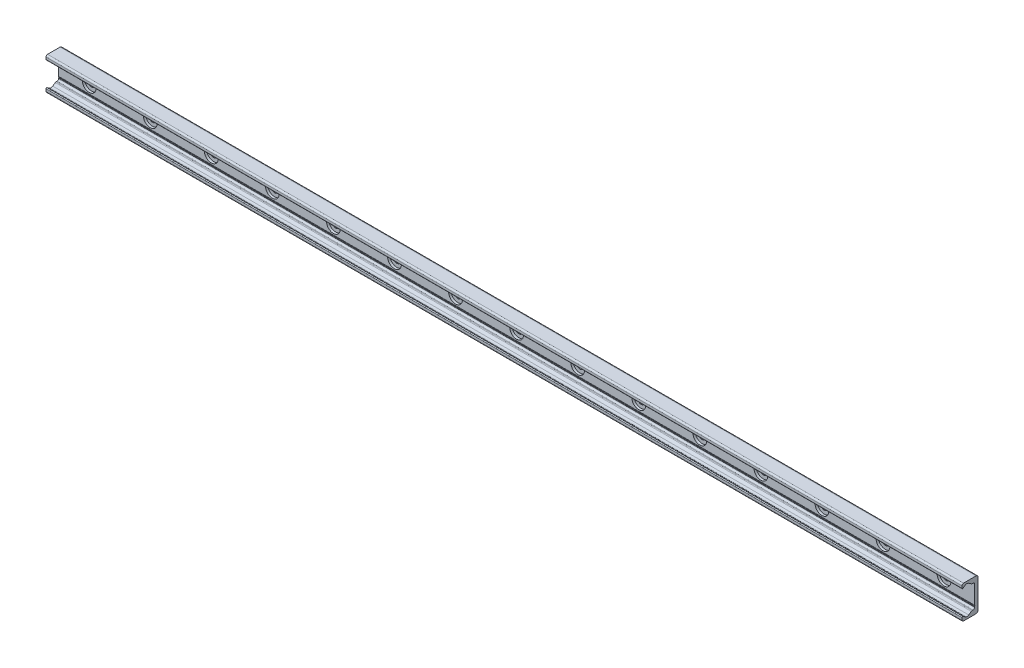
from build123d import *

# Parameters (mm, degrees)
BOSS_EXTRUDE1_DEPTH = 600
SKETCH2_R           = 9
SKETCH2_R_2         = 4.5
CUT_EXTRUDE1_DEPTH  = 3.1
SKETCH2_2_R         = 4.5
CUT_EXTRUDE2_DEPTH  = 601.611771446
LPATTERN1_COUNT     = 15
LPATTERN1_PITCH     = 80


with BuildPart() as part:
    # Sketch1 → Boss-Extrude1 (new, symmetric)
    with BuildSketch(Plane(origin=(0, 0, 0), x_dir=(0, 0, -1), z_dir=(1, 0, 0))):
        with BuildLine():
            Line((0, 0), (0, 19))
            ThreePointArc((0, 19), (-0.732233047, 20.767766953), (-2.5, 21.5))
            Line((-2.5, 21.5), (-19, 21.5))
            ThreePointArc((-19, 21.5), (-20.414213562, 20.914213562), (-21, 19.5))
            Line((-21, 19.5), (-21, 16.625057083))
            ThreePointArc((-21, 16.625057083), (-20.553251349, 15.888838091), (-19.693931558, 15.945160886))
            Line((-19.693931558, 15.945160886), (-16.794305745, 17.975500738))
            ThreePointArc((-16.794305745, 17.975500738), (-14.5, 18.69889256), (-12.205694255, 17.975500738))
            Line((-12.205694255, 17.975500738), (-8.829831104, 15.611695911))
            ThreePointArc((-8.829831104, 15.611695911), (-8.28408983, 15.342566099), (-7.682678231, 15.25))
            Line((-7.682678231, 15.25), (-6.5, 15.25))
            ThreePointArc((-6.5, 15.25), (-5.085786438, 14.664213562), (-4.5, 13.25))
            Line((-4.5, 13.25), (-4.5, -10.75))
            ThreePointArc((-4.5, -10.75), (-4.25, -11), (-4.5, -11.25))
            Line((-4.5, -11.25), (-4.5, -12.25))
            ThreePointArc((-4.5, -12.25), (-4.25, -12.5), (-4.5, -12.75))
            Line((-4.5, -12.75), (-4.5, -13.25))
            ThreePointArc((-4.5, -13.25), (-5.085786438, -14.664213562), (-6.5, -15.25))
            Line((-6.5, -15.25), (-7.682678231, -15.25))
            ThreePointArc((-7.682678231, -15.25), (-8.28408983, -15.342566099), (-8.829831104, -15.611695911))
            Line((-8.829831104, -15.611695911), (-12.205694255, -17.975500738))
            ThreePointArc((-12.205694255, -17.975500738), (-14.5, -18.69889256), (-16.794305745, -17.975500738))
            Line((-16.794305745, -17.975500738), (-19.693931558, -15.945160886))
            ThreePointArc((-19.693931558, -15.945160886), (-20.553251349, -15.888838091), (-21, -16.625057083))
            Line((-21, -16.625057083), (-21, -19.5))
            ThreePointArc((-21, -19.5), (-20.414213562, -20.914213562), (-19, -21.5))
            Line((-19, -21.5), (-2.5, -21.5))
            ThreePointArc((-2.5, -21.5), (-0.732233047, -20.767766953), (0, -19))
            Line((0, -19), (0, 0))
        make_face()
    extrude(amount=BOSS_EXTRUDE1_DEPTH, both=True)

    # Sketch2 → Cut-Extrude1 (cut)
    with BuildSketch(Plane.XY.offset(4.5)):
        with Locations((560, 0)):
            Circle(SKETCH2_R)
        with Locations((560, 0)):
            Circle(SKETCH2_R_2, mode=Mode.SUBTRACT)
    cut_extrude1 = extrude(amount=-CUT_EXTRUDE1_DEPTH, mode=Mode.SUBTRACT)

    # Sketch2_2 → Cut-Extrude2 (cut, through all)
    with BuildSketch(Plane.XY.offset(4.5)):
        with Locations((560, 0)):
            Circle(SKETCH2_2_R)
    cut_extrude2 = extrude(amount=-CUT_EXTRUDE2_DEPTH, mode=Mode.SUBTRACT)

    # LPattern1: Cut-Extrude1, Cut-Extrude2 ×15
    with Locations(*[(-i * LPATTERN1_PITCH, 0, 0) for i in range(1, LPATTERN1_COUNT)]):
        add(cut_extrude1, mode=Mode.SUBTRACT)
        add(cut_extrude2, mode=Mode.SUBTRACT)


solid = part.part
